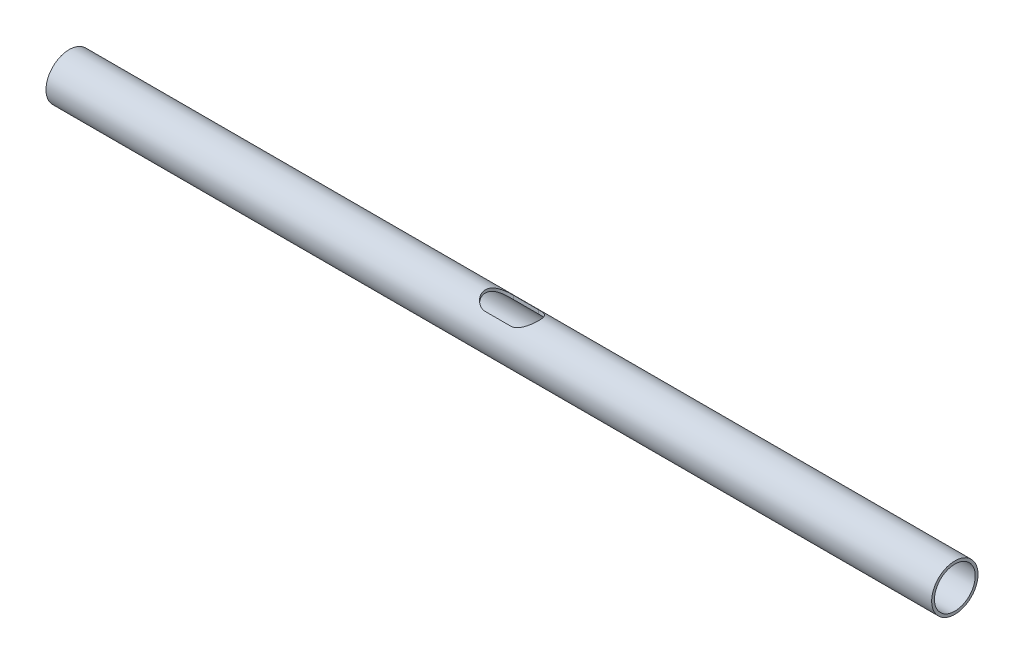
ISO-10303-21;
HEADER;
FILE_DESCRIPTION(('STEP AP214'),'2;1');
FILE_NAME('part.step','',(''),(''),'','','');
FILE_SCHEMA(('AUTOMOTIVE_DESIGN { 1 0 10303 214 1 1 1 1 }'));
ENDSEC;
DATA;
#1=APPLICATION_CONTEXT('core data for automotive mechanical design processes');
#2=APPLICATION_PROTOCOL_DEFINITION('international standard','automotive_design',2000,#1);
#3=PRODUCT_CONTEXT('',#1,'mechanical');
#4=PRODUCT('Part','Part','',(#3));
#5=PRODUCT_RELATED_PRODUCT_CATEGORY('part','',(#4));
#6=PRODUCT_DEFINITION_FORMATION('','',#4);
#7=PRODUCT_DEFINITION_CONTEXT('part definition',#1,'design');
#8=PRODUCT_DEFINITION('design','',#6,#7);
#9=PRODUCT_DEFINITION_SHAPE('','',#8);
#10=(LENGTH_UNIT() NAMED_UNIT(*) SI_UNIT(.MILLI.,.METRE.));
#11=(NAMED_UNIT(*) PLANE_ANGLE_UNIT() SI_UNIT($,.RADIAN.));
#12=(NAMED_UNIT(*) SI_UNIT($,.STERADIAN.) SOLID_ANGLE_UNIT());
#13=UNCERTAINTY_MEASURE_WITH_UNIT(LENGTH_MEASURE(1.E-05),#10,'distance_accuracy_value','');
#14=(GEOMETRIC_REPRESENTATION_CONTEXT(3) GLOBAL_UNCERTAINTY_ASSIGNED_CONTEXT((#13)) GLOBAL_UNIT_ASSIGNED_CONTEXT((#10,
#11,#12)) REPRESENTATION_CONTEXT('',''));
#15=CARTESIAN_POINT('',(0.,0.,0.));
#16=DIRECTION('',(0.,0.,1.));
#17=DIRECTION('',(1.,0.,0.));
#18=AXIS2_PLACEMENT_3D('',#15,#16,#17);
#19=CARTESIAN_POINT('',(-68.8176638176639,0.,0.));
#20=DIRECTION('',(-1.,0.,0.));
#21=DIRECTION('',(0.,0.,1.));
#22=AXIS2_PLACEMENT_3D('',#19,#20,#21);
#23=CYLINDRICAL_SURFACE('',#22,14.5);
#24=CARTESIAN_POINT('',(-315.,0.,0.));
#25=DIRECTION('',(-1.,0.,0.));
#26=DIRECTION('',(0.,0.,1.));
#27=AXIS2_PLACEMENT_3D('',#24,#25,#26);
#28=CIRCLE('',#27,14.5);
#29=CARTESIAN_POINT('',(-315.,0.,14.5));
#30=VERTEX_POINT('',#29);
#31=EDGE_CURVE('E87',#30,#30,#28,.T.);
#32=ORIENTED_EDGE('',*,*,#31,.T.);
#33=EDGE_LOOP('',(#32));
#34=FACE_BOUND('',#33,.T.);
#35=CARTESIAN_POINT('',(315.,0.,0.));
#36=DIRECTION('',(-1.,0.,0.));
#37=DIRECTION('',(0.,0.,1.));
#38=AXIS2_PLACEMENT_3D('',#35,#36,#37);
#39=CIRCLE('',#38,14.5000000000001);
#40=CARTESIAN_POINT('',(315.,0.,14.5000000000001));
#41=VERTEX_POINT('',#40);
#42=EDGE_CURVE('E153',#41,#41,#39,.T.);
#43=ORIENTED_EDGE('',*,*,#42,.F.);
#44=EDGE_LOOP('',(#43));
#45=FACE_BOUND('',#44,.T.);
#46=DIRECTION('',(-1.,0.,0.));
#47=VECTOR('',#46,1.);
#48=CARTESIAN_POINT('',(-68.8176638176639,10.5000000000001,-9.99999999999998));
#49=LINE('',#48,#47);
#50=CARTESIAN_POINT('',(-9.,10.5000000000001,-10.));
#51=VERTEX_POINT('',#50);
#52=CARTESIAN_POINT('',(9.,10.5,-10.));
#53=VERTEX_POINT('',#52);
#54=EDGE_CURVE('E94',#51,#53,#49,.F.);
#55=ORIENTED_EDGE('',*,*,#54,.F.);
#56=CARTESIAN_POINT('',(-9.,10.5000000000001,10.));
#57=CARTESIAN_POINT('',(-9.12158073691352,10.4999936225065,10.0000021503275));
#58=CARTESIAN_POINT('',(-9.24314018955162,10.5021128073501,9.99778205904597));
#59=CARTESIAN_POINT('',(-9.48593911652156,10.5105394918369,9.98892460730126));
#60=CARTESIAN_POINT('',(-9.60717862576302,10.5168465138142,9.98228775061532));
#61=CARTESIAN_POINT('',(-9.96961718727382,10.5419264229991,9.95582316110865));
#62=CARTESIAN_POINT('',(-10.2099659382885,10.5668585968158,9.92944119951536));
#63=CARTESIAN_POINT('',(-10.6835070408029,10.6315418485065,9.86014746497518));
#64=CARTESIAN_POINT('',(-10.9167482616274,10.6711329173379,9.81741401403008));
#65=CARTESIAN_POINT('',(-11.3772011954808,10.7633720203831,9.71619799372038));
#66=CARTESIAN_POINT('',(-11.6044108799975,10.8160243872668,9.65771019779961));
#67=CARTESIAN_POINT('',(-12.0502441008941,10.9319668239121,9.52626433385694));
#68=CARTESIAN_POINT('',(-12.2689102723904,10.9951925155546,9.45339338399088));
#69=CARTESIAN_POINT('',(-12.6982505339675,11.1303883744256,9.29383761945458));
#70=CARTESIAN_POINT('',(-12.9089251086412,11.2023580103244,9.20715364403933));
#71=CARTESIAN_POINT('',(-13.5295493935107,11.4288217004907,8.92690197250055));
#72=CARTESIAN_POINT('',(-13.9270371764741,11.5935763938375,8.71345315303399));
#73=CARTESIAN_POINT('',(-14.5276154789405,11.8644670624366,8.33749276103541));
#74=CARTESIAN_POINT('',(-14.7428021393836,11.9664849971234,8.19071639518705));
#75=CARTESIAN_POINT('',(-15.1605721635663,12.1724942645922,7.88129904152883));
#76=CARTESIAN_POINT('',(-15.3631546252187,12.2764857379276,7.71865692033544));
#77=CARTESIAN_POINT('',(-15.7552380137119,12.4842134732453,7.37795775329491));
#78=CARTESIAN_POINT('',(-15.9447322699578,12.5879495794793,7.19989294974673));
#79=CARTESIAN_POINT('',(-16.3099011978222,12.793038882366,6.82884272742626));
#80=CARTESIAN_POINT('',(-16.4855760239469,12.8943921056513,6.63585747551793));
#81=CARTESIAN_POINT('',(-16.8492820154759,13.1086344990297,6.20329680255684));
#82=CARTESIAN_POINT('',(-17.0347856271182,13.2207713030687,5.96120990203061));
#83=CARTESIAN_POINT('',(-17.3845313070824,13.436197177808,5.45833612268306));
#84=CARTESIAN_POINT('',(-17.5487696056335,13.539484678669,5.1975459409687));
#85=CARTESIAN_POINT('',(-17.8538271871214,13.7341358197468,4.65890499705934));
#86=CARTESIAN_POINT('',(-17.9946802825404,13.8255166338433,4.38107967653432));
#87=CARTESIAN_POINT('',(-18.2511136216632,13.9937032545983,3.80983021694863));
#88=CARTESIAN_POINT('',(-18.3667044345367,14.0705151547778,3.51641266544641));
#89=CARTESIAN_POINT('',(-18.5437319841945,14.1890707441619,2.99529175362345));
#90=CARTESIAN_POINT('',(-18.6114176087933,14.2347257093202,2.77057865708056));
#91=CARTESIAN_POINT('',(-18.7311388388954,14.3158345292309,2.31523593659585));
#92=CARTESIAN_POINT('',(-18.7831776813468,14.3512904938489,2.08460754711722));
#93=CARTESIAN_POINT('',(-18.8709124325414,14.4112417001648,1.61900444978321));
#94=CARTESIAN_POINT('',(-18.9066185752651,14.4357438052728,1.38403255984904));
#95=CARTESIAN_POINT('',(-18.9612402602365,14.473282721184,0.911220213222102));
#96=CARTESIAN_POINT('',(-18.9801552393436,14.4863191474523,0.673379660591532));
#97=CARTESIAN_POINT('',(-19.0009332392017,14.5006416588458,0.196162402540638));
#98=CARTESIAN_POINT('',(-19.0027650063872,14.5019062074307,-0.0432163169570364));
#99=CARTESIAN_POINT('',(-18.9892676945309,14.492599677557,-0.521255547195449));
#100=CARTESIAN_POINT('',(-18.9739386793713,14.4820286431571,-0.759916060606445));
#101=CARTESIAN_POINT('',(-18.926341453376,14.4492891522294,-1.23478959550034));
#102=CARTESIAN_POINT('',(-18.8940691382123,14.4271178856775,-1.47100200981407));
#103=CARTESIAN_POINT('',(-18.8130411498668,14.3716702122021,-1.93924784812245));
#104=CARTESIAN_POINT('',(-18.7642854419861,14.3383937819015,-2.17128126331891));
#105=CARTESIAN_POINT('',(-18.6521220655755,14.2622509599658,-2.62487797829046));
#106=CARTESIAN_POINT('',(-18.5890417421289,14.21959941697,-2.84655874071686));
#107=CARTESIAN_POINT('',(-18.448401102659,14.1251396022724,-3.28334908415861));
#108=CARTESIAN_POINT('',(-18.3708357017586,14.0733281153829,-3.49845632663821));
#109=CARTESIAN_POINT('',(-18.2020559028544,13.9615127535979,-3.92095722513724));
#110=CARTESIAN_POINT('',(-18.1108454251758,13.9015112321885,-4.12835307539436));
#111=CARTESIAN_POINT('',(-17.9155341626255,13.7742969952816,-4.53476639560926));
#112=CARTESIAN_POINT('',(-17.811428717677,13.7070816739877,-4.73378080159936));
#113=CARTESIAN_POINT('',(-17.578772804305,13.5586297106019,-5.14455505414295));
#114=CARTESIAN_POINT('',(-17.4487902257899,13.4766659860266,-5.35524118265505));
#115=CARTESIAN_POINT('',(-17.1748193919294,13.3066197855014,-5.76481292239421));
#116=CARTESIAN_POINT('',(-17.0308251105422,13.2185346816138,-5.96369339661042));
#117=CARTESIAN_POINT('',(-16.7296288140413,13.0377390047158,-6.34923038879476));
#118=CARTESIAN_POINT('',(-16.5724164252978,12.9450248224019,-6.53587709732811));
#119=CARTESIAN_POINT('',(-16.2456129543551,12.7566092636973,-6.89639766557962));
#120=CARTESIAN_POINT('',(-16.0760206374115,12.6609075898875,-7.07027024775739));
#121=CARTESIAN_POINT('',(-15.6945067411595,12.4513755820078,-7.43401726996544));
#122=CARTESIAN_POINT('',(-15.480354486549,12.3372883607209,-7.62141176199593));
#123=CARTESIAN_POINT('',(-15.0365322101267,12.1100520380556,-7.97754805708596));
#124=CARTESIAN_POINT('',(-14.8068589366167,11.9969031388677,-8.14628593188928));
#125=CARTESIAN_POINT('',(-14.3325649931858,11.7746505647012,-8.46435025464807));
#126=CARTESIAN_POINT('',(-14.0879456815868,11.6655465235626,-8.61367846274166));
#127=CARTESIAN_POINT('',(-13.5844460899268,11.4549024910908,-8.89188743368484));
#128=CARTESIAN_POINT('',(-13.3255707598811,11.3533599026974,-9.02077523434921));
#129=CARTESIAN_POINT('',(-12.6584364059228,11.1128082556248,-9.31708875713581));
#130=CARTESIAN_POINT('',(-12.2411415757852,10.9809965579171,-9.47079409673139));
#131=CARTESIAN_POINT('',(-11.5960869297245,10.8141851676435,-9.65973399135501));
#132=CARTESIAN_POINT('',(-11.378164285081,10.7637756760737,-9.71573400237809));
#133=CARTESIAN_POINT('',(-10.9367400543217,10.6749369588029,-9.8132598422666));
#134=CARTESIAN_POINT('',(-10.7132408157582,10.6365027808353,-9.85479165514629));
#135=CARTESIAN_POINT('',(-10.2433785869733,10.5706015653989,-9.9254698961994));
#136=CARTESIAN_POINT('',(-9.99664880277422,10.5442987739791,-9.95331422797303));
#137=CARTESIAN_POINT('',(-9.62435571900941,10.5178129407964,-9.98127020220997));
#138=CARTESIAN_POINT('',(-9.49971286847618,10.5111455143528,-9.98828720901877));
#139=CARTESIAN_POINT('',(-9.25005456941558,10.5022347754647,-9.99765406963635));
#140=CARTESIAN_POINT('',(-9.12503901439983,10.4999928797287,-10.0000024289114));
#141=CARTESIAN_POINT('',(-9.,10.5000000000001,-10.));
#142=B_SPLINE_CURVE_WITH_KNOTS('',3,(#56,#57,#58,#59,#60,#61,#62,#63,#64,#65,#66,#67,#68,#69,
#70,#71,#72,#73,#74,#75,#76,#77,#78,#79,#80,#81,#82,#83,#84,#85,#86,#87,#88,#89,#90,#91,#92,#93,
#94,#95,#96,#97,#98,#99,#100,#101,#102,#103,#104,#105,#106,#107,#108,#109,#110,#111,#112,#113,
#114,#115,#116,#117,#118,#119,#120,#121,#122,#123,#124,#125,#126,#127,#128,#129,#130,#131,#132,
#133,#134,#135,#136,#137,#138,#139,#140,#141),.UNSPECIFIED.,.F.,.F.,(4,2,2,2,2,2,2,2,2,2,2,2,2,
2,2,2,2,2,2,2,2,2,2,2,2,2,2,2,2,2,2,2,2,2,2,2,2,2,2,2,2,2,4),(0.,0.36466204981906,
0.729282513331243,1.45724028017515,2.17747565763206,2.89795027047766,3.61418798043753,
4.33038218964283,5.76618174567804,6.60484172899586,7.44356166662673,8.2827059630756,
9.1218408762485,10.0953768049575,11.0690850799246,12.0413729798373,13.0132533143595,
13.7297739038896,14.4461461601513,15.1620689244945,15.8780156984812,16.5952720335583,
17.3125256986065,18.029953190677,18.7473821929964,19.4498245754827,20.1525140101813,
20.8550019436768,21.5577444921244,22.3392994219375,23.1211919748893,23.9037039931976,
24.6862941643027,25.6050568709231,26.5240126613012,27.442885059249,28.3614403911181,
29.7469828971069,30.4380487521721,31.1288284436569,31.8765122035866,32.2514214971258,
32.6264507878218),.UNSPECIFIED.);
#143=CARTESIAN_POINT('',(-9.,10.5,10.));
#144=VERTEX_POINT('',#143);
#145=EDGE_CURVE('E120',#144,#51,#142,.T.);
#146=ORIENTED_EDGE('',*,*,#145,.F.);
#147=DIRECTION('',(-1.,0.,0.));
#148=VECTOR('',#147,1.);
#149=CARTESIAN_POINT('',(-68.8176638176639,10.5,10.));
#150=LINE('',#149,#148);
#151=CARTESIAN_POINT('',(9.00000000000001,10.5000000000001,10.));
#152=VERTEX_POINT('',#151);
#153=EDGE_CURVE('E127',#144,#152,#150,.F.);
#154=ORIENTED_EDGE('',*,*,#153,.T.);
#155=CARTESIAN_POINT('',(9.,10.5,-10.));
#156=CARTESIAN_POINT('',(9.12158073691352,10.4999936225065,-10.0000021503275));
#157=CARTESIAN_POINT('',(9.24314018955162,10.5021128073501,-9.99778205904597));
#158=CARTESIAN_POINT('',(9.48593911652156,10.5105394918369,-9.98892460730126));
#159=CARTESIAN_POINT('',(9.60717862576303,10.5168465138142,-9.98228775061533));
#160=CARTESIAN_POINT('',(9.96961718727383,10.5419264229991,-9.95582316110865));
#161=CARTESIAN_POINT('',(10.2099659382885,10.5668585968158,-9.92944119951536));
#162=CARTESIAN_POINT('',(10.6835070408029,10.6315418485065,-9.86014746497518));
#163=CARTESIAN_POINT('',(10.9167482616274,10.6711329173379,-9.81741401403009));
#164=CARTESIAN_POINT('',(11.3772011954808,10.7633720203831,-9.71619799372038));
#165=CARTESIAN_POINT('',(11.6044108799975,10.8160243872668,-9.65771019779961));
#166=CARTESIAN_POINT('',(12.0502441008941,10.9319668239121,-9.52626433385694));
#167=CARTESIAN_POINT('',(12.2689102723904,10.9951925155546,-9.45339338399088));
#168=CARTESIAN_POINT('',(12.6982505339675,11.1303883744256,-9.29383761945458));
#169=CARTESIAN_POINT('',(12.9089251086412,11.2023580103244,-9.20715364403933));
#170=CARTESIAN_POINT('',(13.5295493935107,11.4288217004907,-8.92690197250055));
#171=CARTESIAN_POINT('',(13.9270371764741,11.5935763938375,-8.71345315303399));
#172=CARTESIAN_POINT('',(14.5276154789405,11.8644670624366,-8.33749276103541));
#173=CARTESIAN_POINT('',(14.7428021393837,11.9664849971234,-8.19071639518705));
#174=CARTESIAN_POINT('',(15.1605721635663,12.1724942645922,-7.88129904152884));
#175=CARTESIAN_POINT('',(15.3631546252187,12.2764857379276,-7.71865692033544));
#176=CARTESIAN_POINT('',(15.7552380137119,12.4842134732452,-7.37795775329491));
#177=CARTESIAN_POINT('',(15.9447322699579,12.5879495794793,-7.19989294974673));
#178=CARTESIAN_POINT('',(16.3099011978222,12.793038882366,-6.82884272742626));
#179=CARTESIAN_POINT('',(16.4855760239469,12.8943921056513,-6.63585747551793));
#180=CARTESIAN_POINT('',(16.8492820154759,13.1086344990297,-6.20329680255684));
#181=CARTESIAN_POINT('',(17.0347856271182,13.2207713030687,-5.96120990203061));
#182=CARTESIAN_POINT('',(17.3845313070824,13.436197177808,-5.45833612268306));
#183=CARTESIAN_POINT('',(17.5487696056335,13.539484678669,-5.1975459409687));
#184=CARTESIAN_POINT('',(17.8538271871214,13.7341358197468,-4.65890499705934));
#185=CARTESIAN_POINT('',(17.9946802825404,13.8255166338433,-4.38107967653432));
#186=CARTESIAN_POINT('',(18.2511136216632,13.9937032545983,-3.80983021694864));
#187=CARTESIAN_POINT('',(18.3667044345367,14.0705151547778,-3.51641266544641));
#188=CARTESIAN_POINT('',(18.5437319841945,14.1890707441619,-2.99529175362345));
#189=CARTESIAN_POINT('',(18.6114176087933,14.2347257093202,-2.77057865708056));
#190=CARTESIAN_POINT('',(18.7311388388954,14.3158345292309,-2.31523593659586));
#191=CARTESIAN_POINT('',(18.7831776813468,14.3512904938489,-2.08460754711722));
#192=CARTESIAN_POINT('',(18.8709124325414,14.4112417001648,-1.61900444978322));
#193=CARTESIAN_POINT('',(18.9066185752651,14.4357438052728,-1.38403255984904));
#194=CARTESIAN_POINT('',(18.9612402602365,14.473282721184,-0.911220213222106));
#195=CARTESIAN_POINT('',(18.9801552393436,14.4863191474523,-0.673379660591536));
#196=CARTESIAN_POINT('',(19.0009332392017,14.5006416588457,-0.196162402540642));
#197=CARTESIAN_POINT('',(19.0027650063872,14.5019062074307,0.0432163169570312));
#198=CARTESIAN_POINT('',(18.9892676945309,14.492599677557,0.521255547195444));
#199=CARTESIAN_POINT('',(18.9739386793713,14.4820286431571,0.759916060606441));
#200=CARTESIAN_POINT('',(18.926341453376,14.4492891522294,1.23478959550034));
#201=CARTESIAN_POINT('',(18.8940691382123,14.4271178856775,1.47100200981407));
#202=CARTESIAN_POINT('',(18.8130411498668,14.3716702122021,1.93924784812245));
#203=CARTESIAN_POINT('',(18.7642854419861,14.3383937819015,2.17128126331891));
#204=CARTESIAN_POINT('',(18.6521220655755,14.2622509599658,2.62487797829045));
#205=CARTESIAN_POINT('',(18.5890417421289,14.21959941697,2.84655874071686));
#206=CARTESIAN_POINT('',(18.448401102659,14.1251396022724,3.28334908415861));
#207=CARTESIAN_POINT('',(18.3708357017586,14.0733281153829,3.49845632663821));
#208=CARTESIAN_POINT('',(18.2020559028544,13.9615127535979,3.92095722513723));
#209=CARTESIAN_POINT('',(18.1108454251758,13.9015112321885,4.12835307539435));
#210=CARTESIAN_POINT('',(17.9155341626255,13.7742969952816,4.53476639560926));
#211=CARTESIAN_POINT('',(17.811428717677,13.7070816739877,4.73378080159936));
#212=CARTESIAN_POINT('',(17.578772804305,13.5586297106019,5.14455505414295));
#213=CARTESIAN_POINT('',(17.4487902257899,13.4766659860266,5.35524118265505));
#214=CARTESIAN_POINT('',(17.1748193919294,13.3066197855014,5.7648129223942));
#215=CARTESIAN_POINT('',(17.0308251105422,13.2185346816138,5.96369339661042));
#216=CARTESIAN_POINT('',(16.7296288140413,13.0377390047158,6.34923038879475));
#217=CARTESIAN_POINT('',(16.5724164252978,12.9450248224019,6.5358770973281));
#218=CARTESIAN_POINT('',(16.2456129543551,12.7566092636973,6.89639766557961));
#219=CARTESIAN_POINT('',(16.0760206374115,12.6609075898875,7.07027024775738));
#220=CARTESIAN_POINT('',(15.6945067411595,12.4513755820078,7.43401726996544));
#221=CARTESIAN_POINT('',(15.480354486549,12.3372883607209,7.62141176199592));
#222=CARTESIAN_POINT('',(15.0365322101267,12.1100520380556,7.97754805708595));
#223=CARTESIAN_POINT('',(14.8068589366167,11.9969031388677,8.14628593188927));
#224=CARTESIAN_POINT('',(14.3325649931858,11.7746505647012,8.46435025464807));
#225=CARTESIAN_POINT('',(14.0879456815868,11.6655465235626,8.61367846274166));
#226=CARTESIAN_POINT('',(13.5844460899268,11.4549024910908,8.89188743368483));
#227=CARTESIAN_POINT('',(13.3255707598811,11.3533599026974,9.02077523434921));
#228=CARTESIAN_POINT('',(12.6584364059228,11.1128082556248,9.31708875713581));
#229=CARTESIAN_POINT('',(12.2411415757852,10.9809965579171,9.47079409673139));
#230=CARTESIAN_POINT('',(11.5960869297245,10.8141851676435,9.659733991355));
#231=CARTESIAN_POINT('',(11.378164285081,10.7637756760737,9.71573400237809));
#232=CARTESIAN_POINT('',(10.9367400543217,10.6749369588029,9.8132598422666));
#233=CARTESIAN_POINT('',(10.7132408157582,10.6365027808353,9.85479165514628));
#234=CARTESIAN_POINT('',(10.2433785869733,10.5706015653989,9.9254698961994));
#235=CARTESIAN_POINT('',(9.99664880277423,10.5442987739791,9.95331422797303));
#236=CARTESIAN_POINT('',(9.62435571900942,10.5178129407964,9.98127020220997));
#237=CARTESIAN_POINT('',(9.49971286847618,10.5111455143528,9.98828720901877));
#238=CARTESIAN_POINT('',(9.25005456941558,10.5022347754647,9.99765406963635));
#239=CARTESIAN_POINT('',(9.12503901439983,10.4999928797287,10.0000024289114));
#240=CARTESIAN_POINT('',(9.00000000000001,10.5000000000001,10.));
#241=B_SPLINE_CURVE_WITH_KNOTS('',3,(#155,#156,#157,#158,#159,#160,#161,#162,#163,#164,#165,
#166,#167,#168,#169,#170,#171,#172,#173,#174,#175,#176,#177,#178,#179,#180,#181,#182,#183,#184,
#185,#186,#187,#188,#189,#190,#191,#192,#193,#194,#195,#196,#197,#198,#199,#200,#201,#202,#203,
#204,#205,#206,#207,#208,#209,#210,#211,#212,#213,#214,#215,#216,#217,#218,#219,#220,#221,#222,
#223,#224,#225,#226,#227,#228,#229,#230,#231,#232,#233,#234,#235,#236,#237,#238,#239,#240),
.UNSPECIFIED.,.F.,.F.,(4,2,2,2,2,2,2,2,2,2,2,2,2,2,2,2,2,2,2,2,2,2,2,2,2,2,2,2,2,2,2,2,2,2,2,2,
2,2,2,2,2,2,4),(0.,0.364662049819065,0.729282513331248,1.45724028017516,2.17747565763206,
2.89795027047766,3.61418798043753,4.33038218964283,5.76618174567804,6.60484172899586,
7.44356166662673,8.2827059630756,9.1218408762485,10.0953768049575,11.0690850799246,
12.0413729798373,13.0132533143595,13.7297739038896,14.4461461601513,15.1620689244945,
15.8780156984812,16.5952720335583,17.3125256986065,18.029953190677,18.7473821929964,
19.4498245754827,20.1525140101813,20.8550019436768,21.5577444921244,22.3392994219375,
23.1211919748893,23.9037039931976,24.6862941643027,25.6050568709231,26.5240126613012,
27.442885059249,28.3614403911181,29.7469828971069,30.4380487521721,31.1288284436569,
31.8765122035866,32.2514214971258,32.6264507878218),.UNSPECIFIED.);
#242=EDGE_CURVE('E135',#53,#152,#241,.T.);
#243=ORIENTED_EDGE('',*,*,#242,.F.);
#244=EDGE_LOOP('',(#55,#146,#154,#243));
#245=FACE_BOUND('',#244,.T.);
#246=ADVANCED_FACE('F44',(#34,#45,#245),#23,.F.);
#247=CARTESIAN_POINT('',(-68.8176638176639,0.,0.));
#248=DIRECTION('',(-1.,0.,0.));
#249=DIRECTION('',(0.,0.,1.));
#250=AXIS2_PLACEMENT_3D('',#247,#248,#249);
#251=CYLINDRICAL_SURFACE('',#250,16.5);
#252=CARTESIAN_POINT('',(315.,0.,0.));
#253=DIRECTION('',(-1.,0.,0.));
#254=DIRECTION('',(0.,0.,1.));
#255=AXIS2_PLACEMENT_3D('',#252,#253,#254);
#256=CIRCLE('',#255,16.5000000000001);
#257=CARTESIAN_POINT('',(315.,0.,16.5000000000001));
#258=VERTEX_POINT('',#257);
#259=EDGE_CURVE('E156',#258,#258,#256,.T.);
#260=ORIENTED_EDGE('',*,*,#259,.T.);
#261=EDGE_LOOP('',(#260));
#262=FACE_BOUND('',#261,.T.);
#263=CARTESIAN_POINT('',(-315.,0.,0.));
#264=DIRECTION('',(-1.,0.,0.));
#265=DIRECTION('',(0.,0.,1.));
#266=AXIS2_PLACEMENT_3D('',#263,#264,#265);
#267=CIRCLE('',#266,16.5);
#268=CARTESIAN_POINT('',(-315.,0.,16.5));
#269=VERTEX_POINT('',#268);
#270=EDGE_CURVE('E158',#269,#269,#267,.T.);
#271=ORIENTED_EDGE('',*,*,#270,.F.);
#272=EDGE_LOOP('',(#271));
#273=FACE_BOUND('',#272,.T.);
#274=DIRECTION('',(-1.,0.,0.));
#275=VECTOR('',#274,1.);
#276=CARTESIAN_POINT('',(-68.8176638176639,13.1244047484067,-9.99999999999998));
#277=LINE('',#276,#275);
#278=CARTESIAN_POINT('',(9.,13.1244047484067,-10.));
#279=VERTEX_POINT('',#278);
#280=CARTESIAN_POINT('',(-9.,13.1244047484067,-10.));
#281=VERTEX_POINT('',#280);
#282=EDGE_CURVE('E13',#279,#281,#277,.T.);
#283=ORIENTED_EDGE('',*,*,#282,.F.);
#284=CARTESIAN_POINT('',(9.00000000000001,13.1244047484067,10.));
#285=CARTESIAN_POINT('',(9.12614883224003,13.1244002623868,10.0000015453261));
#286=CARTESIAN_POINT('',(9.25227802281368,13.1262243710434,9.99761236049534));
#287=CARTESIAN_POINT('',(9.50424332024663,13.133484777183,9.98807440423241));
#288=CARTESIAN_POINT('',(9.63007944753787,13.1389208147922,9.98092597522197));
#289=CARTESIAN_POINT('',(10.0064815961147,13.1605617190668,9.95239785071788));
#290=CARTESIAN_POINT('',(10.2562572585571,13.1820996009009,9.92393519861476));
#291=CARTESIAN_POINT('',(10.7494081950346,13.2382338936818,9.84892444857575));
#292=CARTESIAN_POINT('',(10.9928190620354,13.2727223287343,9.80252580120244));
#293=CARTESIAN_POINT('',(11.473728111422,13.3533934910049,9.692344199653));
#294=CARTESIAN_POINT('',(11.7112250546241,13.3995786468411,9.62855763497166));
#295=CARTESIAN_POINT('',(12.1779937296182,13.5017762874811,9.48471270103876));
#296=CARTESIAN_POINT('',(12.4072936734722,13.557750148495,9.40471809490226));
#297=CARTESIAN_POINT('',(12.8575751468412,13.677857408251,9.2291671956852));
#298=CARTESIAN_POINT('',(13.0785569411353,13.7419905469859,9.13361139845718));
#299=CARTESIAN_POINT('',(13.7287873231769,13.9442272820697,8.82435432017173));
#300=CARTESIAN_POINT('',(14.1445770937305,14.0919952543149,8.58829585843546));
#301=CARTESIAN_POINT('',(14.984525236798,14.4186129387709,8.02936294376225));
#302=CARTESIAN_POINT('',(15.4033158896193,14.5990439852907,7.69934929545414));
#303=CARTESIAN_POINT('',(15.9884624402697,14.8680456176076,7.15766138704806));
#304=CARTESIAN_POINT('',(16.1764204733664,14.9574825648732,6.96921592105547));
#305=CARTESIAN_POINT('',(16.5373096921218,15.133942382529,6.57722806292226));
#306=CARTESIAN_POINT('',(16.7102377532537,15.2209647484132,6.37368254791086));
#307=CARTESIAN_POINT('',(17.0584546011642,15.4001294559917,5.92872508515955));
#308=CARTESIAN_POINT('',(17.2318527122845,15.4917592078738,5.68562239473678));
#309=CARTESIAN_POINT('',(17.5572588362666,15.6670961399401,5.1829439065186));
#310=CARTESIAN_POINT('',(17.7092765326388,15.750806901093,4.92337564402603));
#311=CARTESIAN_POINT('',(17.990321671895,15.9079324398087,4.38920850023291));
#312=CARTESIAN_POINT('',(18.119357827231,15.9813511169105,4.11461536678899));
#313=CARTESIAN_POINT('',(18.3527786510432,16.1156865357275,3.55220756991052));
#314=CARTESIAN_POINT('',(18.4571674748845,16.1766053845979,3.26439514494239));
#315=CARTESIAN_POINT('',(18.6308081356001,16.2787602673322,2.70637287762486));
#316=CARTESIAN_POINT('',(18.7024852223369,16.3213319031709,2.43716144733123));
#317=CARTESIAN_POINT('',(18.8233498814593,16.393469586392,1.89201439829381));
#318=CARTESIAN_POINT('',(18.8725387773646,16.4230363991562,1.616079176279));
#319=CARTESIAN_POINT('',(18.9475976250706,16.4682665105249,1.06014822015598));
#320=CARTESIAN_POINT('',(18.9734862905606,16.4839409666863,0.780155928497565));
#321=CARTESIAN_POINT('',(19.0015622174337,16.5009428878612,0.218561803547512));
#322=CARTESIAN_POINT('',(19.0037519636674,16.5022718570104,-0.0630398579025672));
#323=CARTESIAN_POINT('',(18.9856320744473,16.4912952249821,-0.589481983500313));
#324=CARTESIAN_POINT('',(18.9681368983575,16.4806951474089,-0.834461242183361));
#325=CARTESIAN_POINT('',(18.9152886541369,16.4487842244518,-1.32178278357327));
#326=CARTESIAN_POINT('',(18.8799356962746,16.4274734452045,-1.56412508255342));
#327=CARTESIAN_POINT('',(18.7918211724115,16.3746304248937,-2.0444732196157));
#328=CARTESIAN_POINT('',(18.7390598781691,16.3430983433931,-2.28247912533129));
#329=CARTESIAN_POINT('',(18.616752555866,16.2705103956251,-2.7526499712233));
#330=CARTESIAN_POINT('',(18.5472058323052,16.2294541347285,-2.98481466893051));
#331=CARTESIAN_POINT('',(18.391705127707,16.1384674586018,-3.44306624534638));
#332=CARTESIAN_POINT('',(18.3056739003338,16.0884953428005,-3.66911855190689));
#333=CARTESIAN_POINT('',(18.1182223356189,15.9808038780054,-4.1129150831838));
#334=CARTESIAN_POINT('',(18.0167968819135,15.9230819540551,-4.33065651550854));
#335=CARTESIAN_POINT('',(17.7994510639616,15.8010207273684,-4.75676936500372));
#336=CARTESIAN_POINT('',(17.6835339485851,15.7366829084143,-4.9651428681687));
#337=CARTESIAN_POINT('',(17.4379727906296,15.6025256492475,-5.37187831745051));
#338=CARTESIAN_POINT('',(17.3083238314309,15.5327042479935,-5.57023663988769));
#339=CARTESIAN_POINT('',(17.0197310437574,15.380160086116,-5.97945728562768));
#340=CARTESIAN_POINT('',(16.8591391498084,15.2968953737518,-6.18895661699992));
#341=CARTESIAN_POINT('',(16.522648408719,15.1267695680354,-6.59386824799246));
#342=CARTESIAN_POINT('',(16.3467425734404,15.0399068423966,-6.78927404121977));
#343=CARTESIAN_POINT('',(15.9802846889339,14.8643355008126,-7.16552047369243));
#344=CARTESIAN_POINT('',(15.7897126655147,14.7756244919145,-7.34634053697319));
#345=CARTESIAN_POINT('',(15.3948886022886,14.5984067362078,-7.69248552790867));
#346=CARTESIAN_POINT('',(15.1906360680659,14.5098999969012,-7.857809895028));
#347=CARTESIAN_POINT('',(14.7437252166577,14.3246009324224,-8.19124063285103));
#348=CARTESIAN_POINT('',(14.4994038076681,14.228094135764,-8.35728508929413));
#349=CARTESIAN_POINT('',(13.9953197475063,14.040956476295,-8.66801307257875));
#350=CARTESIAN_POINT('',(13.7355546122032,13.9503265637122,-8.81269314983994));
#351=CARTESIAN_POINT('',(13.2025474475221,13.7785332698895,-9.07893429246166));
#352=CARTESIAN_POINT('',(12.9293518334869,13.697340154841,-9.20056877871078));
#353=CARTESIAN_POINT('',(12.37018397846,13.5475350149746,-9.41976357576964));
#354=CARTESIAN_POINT('',(12.0842169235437,13.4789179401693,-9.51733355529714));
#355=CARTESIAN_POINT('',(11.5700198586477,13.3718906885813,-9.66689642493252));
#356=CARTESIAN_POINT('',(11.3440159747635,13.3301713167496,-9.72421162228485));
#357=CARTESIAN_POINT('',(10.8869581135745,13.2574412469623,-9.82313751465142));
#358=CARTESIAN_POINT('',(10.6559058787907,13.2264269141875,-9.8647535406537));
#359=CARTESIAN_POINT('',(10.1884520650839,13.1760420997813,-9.93195402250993));
#360=CARTESIAN_POINT('',(9.9520238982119,13.1567573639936,-9.95742047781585));
#361=CARTESIAN_POINT('',(9.59589855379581,13.137388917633,-9.98294100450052));
#362=CARTESIAN_POINT('',(9.47687067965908,13.1325258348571,-9.98933467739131));
#363=CARTESIAN_POINT('',(9.238567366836,13.1260318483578,-9.99786493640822));
#364=CARTESIAN_POINT('',(9.11929191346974,13.124401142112,-10.0000012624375));
#365=CARTESIAN_POINT('',(9.,13.1244047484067,-10.));
#366=B_SPLINE_CURVE_WITH_KNOTS('',3,(#284,#285,#286,#287,#288,#289,#290,#291,#292,#293,#294,
#295,#296,#297,#298,#299,#300,#301,#302,#303,#304,#305,#306,#307,#308,#309,#310,#311,#312,#313,
#314,#315,#316,#317,#318,#319,#320,#321,#322,#323,#324,#325,#326,#327,#328,#329,#330,#331,#332,
#333,#334,#335,#336,#337,#338,#339,#340,#341,#342,#343,#344,#345,#346,#347,#348,#349,#350,#351,
#352,#353,#354,#355,#356,#357,#358,#359,#360,#361,#362,#363,#364,#365),.UNSPECIFIED.,.F.,.F.,(4,
2,2,2,2,2,2,2,2,2,2,2,2,2,2,2,2,2,2,2,2,2,2,2,2,2,2,2,2,2,2,2,2,2,2,2,2,2,2,2,4),(0.,
0.3783721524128,0.75671708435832,1.51246316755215,2.26204325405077,3.01177910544,
3.75862081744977,4.50543873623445,6.00144445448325,7.68314807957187,8.52483413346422,
9.3666947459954,10.302516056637,11.2379121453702,12.1729528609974,13.1078358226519,
13.9520880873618,14.796290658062,15.6398145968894,16.4832500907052,17.2198630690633,
17.9564714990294,18.6930684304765,19.4296958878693,20.1698635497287,20.9102777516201,
21.650526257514,22.3910407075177,23.2205667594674,24.0504733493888,24.8815309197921,
25.7126185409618,26.6437758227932,27.575083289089,28.5033718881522,29.4312869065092,
30.1411200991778,30.8507120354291,31.5654307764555,31.9232220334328,32.2810351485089),.UNSPECIFIED.);
#367=CARTESIAN_POINT('',(9.00000000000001,13.1244047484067,10.));
#368=VERTEX_POINT('',#367);
#369=EDGE_CURVE('E81',#368,#279,#366,.T.);
#370=ORIENTED_EDGE('',*,*,#369,.F.);
#371=DIRECTION('',(-1.,0.,0.));
#372=VECTOR('',#371,1.);
#373=CARTESIAN_POINT('',(-68.8176638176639,13.1244047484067,10.));
#374=LINE('',#373,#372);
#375=CARTESIAN_POINT('',(-9.,13.1244047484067,10.));
#376=VERTEX_POINT('',#375);
#377=EDGE_CURVE('E86',#368,#376,#374,.T.);
#378=ORIENTED_EDGE('',*,*,#377,.T.);
#379=CARTESIAN_POINT('',(-9.,13.1244047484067,-10.));
#380=CARTESIAN_POINT('',(-9.12614883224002,13.1244002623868,-10.0000015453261));
#381=CARTESIAN_POINT('',(-9.25227802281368,13.1262243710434,-9.99761236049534));
#382=CARTESIAN_POINT('',(-9.50424332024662,13.133484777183,-9.98807440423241));
#383=CARTESIAN_POINT('',(-9.63007944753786,13.1389208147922,-9.98092597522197));
#384=CARTESIAN_POINT('',(-10.0064815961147,13.1605617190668,-9.95239785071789));
#385=CARTESIAN_POINT('',(-10.2562572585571,13.1820996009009,-9.92393519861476));
#386=CARTESIAN_POINT('',(-10.7494081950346,13.2382338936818,-9.84892444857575));
#387=CARTESIAN_POINT('',(-10.9928190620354,13.2727223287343,-9.80252580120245));
#388=CARTESIAN_POINT('',(-11.473728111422,13.3533934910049,-9.692344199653));
#389=CARTESIAN_POINT('',(-11.7112250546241,13.3995786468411,-9.62855763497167));
#390=CARTESIAN_POINT('',(-12.1779937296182,13.5017762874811,-9.48471270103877));
#391=CARTESIAN_POINT('',(-12.4072936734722,13.557750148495,-9.40471809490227));
#392=CARTESIAN_POINT('',(-12.8575751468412,13.677857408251,-9.22916719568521));
#393=CARTESIAN_POINT('',(-13.0785569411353,13.7419905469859,-9.13361139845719));
#394=CARTESIAN_POINT('',(-13.7287873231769,13.9442272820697,-8.82435432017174));
#395=CARTESIAN_POINT('',(-14.1445770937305,14.0919952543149,-8.58829585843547));
#396=CARTESIAN_POINT('',(-14.984525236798,14.4186129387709,-8.02936294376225));
#397=CARTESIAN_POINT('',(-15.4033158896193,14.5990439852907,-7.69934929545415));
#398=CARTESIAN_POINT('',(-15.9884624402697,14.8680456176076,-7.15766138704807));
#399=CARTESIAN_POINT('',(-16.1764204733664,14.9574825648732,-6.96921592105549));
#400=CARTESIAN_POINT('',(-16.5373096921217,15.133942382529,-6.57722806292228));
#401=CARTESIAN_POINT('',(-16.7102377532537,15.2209647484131,-6.37368254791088));
#402=CARTESIAN_POINT('',(-17.0584546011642,15.4001294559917,-5.92872508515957));
#403=CARTESIAN_POINT('',(-17.2318527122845,15.4917592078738,-5.68562239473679));
#404=CARTESIAN_POINT('',(-17.5572588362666,15.6670961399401,-5.18294390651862));
#405=CARTESIAN_POINT('',(-17.7092765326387,15.750806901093,-4.92337564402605));
#406=CARTESIAN_POINT('',(-17.990321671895,15.9079324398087,-4.38920850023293));
#407=CARTESIAN_POINT('',(-18.119357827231,15.9813511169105,-4.11461536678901));
#408=CARTESIAN_POINT('',(-18.3527786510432,16.1156865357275,-3.55220756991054));
#409=CARTESIAN_POINT('',(-18.4571674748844,16.1766053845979,-3.26439514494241));
#410=CARTESIAN_POINT('',(-18.6308081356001,16.2787602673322,-2.70637287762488));
#411=CARTESIAN_POINT('',(-18.7024852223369,16.3213319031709,-2.43716144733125));
#412=CARTESIAN_POINT('',(-18.8233498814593,16.393469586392,-1.89201439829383));
#413=CARTESIAN_POINT('',(-18.8725387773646,16.4230363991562,-1.61607917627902));
#414=CARTESIAN_POINT('',(-18.9475976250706,16.4682665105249,-1.060148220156));
#415=CARTESIAN_POINT('',(-18.9734862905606,16.4839409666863,-0.780155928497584));
#416=CARTESIAN_POINT('',(-19.0015622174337,16.5009428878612,-0.21856180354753));
#417=CARTESIAN_POINT('',(-19.0037519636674,16.5022718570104,0.0630398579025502));
#418=CARTESIAN_POINT('',(-18.9856320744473,16.4912952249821,0.589481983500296));
#419=CARTESIAN_POINT('',(-18.9681368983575,16.4806951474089,0.834461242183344));
#420=CARTESIAN_POINT('',(-18.9152886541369,16.4487842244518,1.32178278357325));
#421=CARTESIAN_POINT('',(-18.8799356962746,16.4274734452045,1.5641250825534));
#422=CARTESIAN_POINT('',(-18.7918211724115,16.3746304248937,2.04447321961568));
#423=CARTESIAN_POINT('',(-18.7390598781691,16.3430983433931,2.28247912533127));
#424=CARTESIAN_POINT('',(-18.616752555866,16.2705103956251,2.75264997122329));
#425=CARTESIAN_POINT('',(-18.5472058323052,16.2294541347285,2.98481466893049));
#426=CARTESIAN_POINT('',(-18.391705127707,16.1384674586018,3.44306624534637));
#427=CARTESIAN_POINT('',(-18.3056739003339,16.0884953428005,3.66911855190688));
#428=CARTESIAN_POINT('',(-18.1182223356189,15.9808038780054,4.11291508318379));
#429=CARTESIAN_POINT('',(-18.0167968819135,15.9230819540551,4.33065651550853));
#430=CARTESIAN_POINT('',(-17.7994510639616,15.8010207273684,4.75676936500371));
#431=CARTESIAN_POINT('',(-17.6835339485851,15.7366829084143,4.96514286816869));
#432=CARTESIAN_POINT('',(-17.4379727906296,15.6025256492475,5.3718783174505));
#433=CARTESIAN_POINT('',(-17.3083238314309,15.5327042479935,5.57023663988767));
#434=CARTESIAN_POINT('',(-17.0197310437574,15.380160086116,5.97945728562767));
#435=CARTESIAN_POINT('',(-16.8591391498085,15.2968953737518,6.18895661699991));
#436=CARTESIAN_POINT('',(-16.522648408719,15.1267695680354,6.59386824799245));
#437=CARTESIAN_POINT('',(-16.3467425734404,15.0399068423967,6.78927404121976));
#438=CARTESIAN_POINT('',(-15.9802846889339,14.8643355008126,7.16552047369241));
#439=CARTESIAN_POINT('',(-15.7897126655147,14.7756244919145,7.34634053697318));
#440=CARTESIAN_POINT('',(-15.3948886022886,14.5984067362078,7.69248552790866));
#441=CARTESIAN_POINT('',(-15.1906360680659,14.5098999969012,7.85780989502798));
#442=CARTESIAN_POINT('',(-14.7437252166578,14.3246009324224,8.19124063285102));
#443=CARTESIAN_POINT('',(-14.4994038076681,14.228094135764,8.35728508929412));
#444=CARTESIAN_POINT('',(-13.9953197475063,14.040956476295,8.66801307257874));
#445=CARTESIAN_POINT('',(-13.7355546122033,13.9503265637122,8.81269314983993));
#446=CARTESIAN_POINT('',(-13.2025474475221,13.7785332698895,9.07893429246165));
#447=CARTESIAN_POINT('',(-12.9293518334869,13.697340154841,9.20056877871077));
#448=CARTESIAN_POINT('',(-12.3701839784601,13.5475350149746,9.41976357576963));
#449=CARTESIAN_POINT('',(-12.0842169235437,13.4789179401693,9.51733355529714));
#450=CARTESIAN_POINT('',(-11.5700198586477,13.3718906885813,9.66689642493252));
#451=CARTESIAN_POINT('',(-11.3440159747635,13.3301713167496,9.72421162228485));
#452=CARTESIAN_POINT('',(-10.8869581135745,13.2574412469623,9.82313751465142));
#453=CARTESIAN_POINT('',(-10.6559058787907,13.2264269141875,9.8647535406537));
#454=CARTESIAN_POINT('',(-10.1884520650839,13.1760420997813,9.93195402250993));
#455=CARTESIAN_POINT('',(-9.9520238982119,13.1567573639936,9.95742047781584));
#456=CARTESIAN_POINT('',(-9.59589855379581,13.137388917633,9.98294100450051));
#457=CARTESIAN_POINT('',(-9.47687067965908,13.1325258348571,9.98933467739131));
#458=CARTESIAN_POINT('',(-9.238567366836,13.1260318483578,9.99786493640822));
#459=CARTESIAN_POINT('',(-9.11929191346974,13.124401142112,10.0000012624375));
#460=CARTESIAN_POINT('',(-9.,13.1244047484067,10.));
#461=B_SPLINE_CURVE_WITH_KNOTS('',3,(#379,#380,#381,#382,#383,#384,#385,#386,#387,#388,#389,
#390,#391,#392,#393,#394,#395,#396,#397,#398,#399,#400,#401,#402,#403,#404,#405,#406,#407,#408,
#409,#410,#411,#412,#413,#414,#415,#416,#417,#418,#419,#420,#421,#422,#423,#424,#425,#426,#427,
#428,#429,#430,#431,#432,#433,#434,#435,#436,#437,#438,#439,#440,#441,#442,#443,#444,#445,#446,
#447,#448,#449,#450,#451,#452,#453,#454,#455,#456,#457,#458,#459,#460),.UNSPECIFIED.,.F.,.F.,(4,
2,2,2,2,2,2,2,2,2,2,2,2,2,2,2,2,2,2,2,2,2,2,2,2,2,2,2,2,2,2,2,2,2,2,2,2,2,2,2,4),(0.,
0.378372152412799,0.756717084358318,1.51246316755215,2.26204325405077,3.01177910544,
3.75862081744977,4.50543873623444,6.00144445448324,7.68314807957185,8.5248341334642,
9.36669474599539,10.302516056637,11.2379121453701,12.1729528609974,13.1078358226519,
13.9520880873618,14.7962906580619,15.6398145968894,16.4832500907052,17.2198630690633,
17.9564714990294,18.6930684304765,19.4296958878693,20.1698635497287,20.9102777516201,
21.650526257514,22.3910407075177,23.2205667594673,24.0504733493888,24.8815309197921,
25.7126185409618,26.6437758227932,27.575083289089,28.5033718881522,29.4312869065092,
30.1411200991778,30.8507120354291,31.5654307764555,31.9232220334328,32.2810351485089),.UNSPECIFIED.);
#462=EDGE_CURVE('E52',#281,#376,#461,.T.);
#463=ORIENTED_EDGE('',*,*,#462,.F.);
#464=EDGE_LOOP('',(#283,#370,#378,#463));
#465=FACE_BOUND('',#464,.T.);
#466=ADVANCED_FACE('F98',(#262,#273,#465),#251,.T.);
#467=CARTESIAN_POINT('',(-315.,16.5,0.));
#468=DIRECTION('',(1.,0.,0.));
#469=DIRECTION('',(0.,0.,-1.));
#470=AXIS2_PLACEMENT_3D('',#467,#468,#469);
#471=PLANE('',#470);
#472=ORIENTED_EDGE('',*,*,#31,.F.);
#473=EDGE_LOOP('',(#472));
#474=FACE_BOUND('',#473,.T.);
#475=ORIENTED_EDGE('',*,*,#270,.T.);
#476=EDGE_LOOP('',(#475));
#477=FACE_BOUND('',#476,.T.);
#478=ADVANCED_FACE('F46',(#474,#477),#471,.F.);
#479=CARTESIAN_POINT('',(315.,16.5000000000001,0.));
#480=DIRECTION('',(-1.,0.,0.));
#481=DIRECTION('',(0.,0.,1.));
#482=AXIS2_PLACEMENT_3D('',#479,#480,#481);
#483=PLANE('',#482);
#484=ORIENTED_EDGE('',*,*,#259,.F.);
#485=EDGE_LOOP('',(#484));
#486=FACE_BOUND('',#485,.T.);
#487=ORIENTED_EDGE('',*,*,#42,.T.);
#488=EDGE_LOOP('',(#487));
#489=FACE_BOUND('',#488,.T.);
#490=ADVANCED_FACE('F133',(#486,#489),#483,.F.);
#491=CARTESIAN_POINT('',(8.99999999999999,36.,-10.));
#492=DIRECTION('',(0.,0.,1.));
#493=DIRECTION('',(1.,0.,0.));
#494=AXIS2_PLACEMENT_3D('',#491,#492,#493);
#495=PLANE('',#494);
#496=ORIENTED_EDGE('',*,*,#54,.T.);
#497=DIRECTION('',(0.,-1.,0.));
#498=VECTOR('',#497,1.);
#499=CARTESIAN_POINT('',(9.,36.,-10.));
#500=LINE('',#499,#498);
#501=EDGE_CURVE('E59',#279,#53,#500,.T.);
#502=ORIENTED_EDGE('',*,*,#501,.F.);
#503=ORIENTED_EDGE('',*,*,#282,.T.);
#504=DIRECTION('',(0.,-1.,0.));
#505=VECTOR('',#504,1.);
#506=CARTESIAN_POINT('',(-9.,36.,-10.));
#507=LINE('',#506,#505);
#508=EDGE_CURVE('E141',#281,#51,#507,.T.);
#509=ORIENTED_EDGE('',*,*,#508,.T.);
#510=EDGE_LOOP('',(#496,#502,#503,#509));
#511=FACE_BOUND('',#510,.T.);
#512=ADVANCED_FACE('F90',(#511),#495,.T.);
#513=CARTESIAN_POINT('',(-9.,36.,0.));
#514=DIRECTION('',(0.,-1.,0.));
#515=DIRECTION('',(0.,0.,-1.));
#516=AXIS2_PLACEMENT_3D('',#513,#514,#515);
#517=CYLINDRICAL_SURFACE('',#516,10.);
#518=ORIENTED_EDGE('',*,*,#145,.T.);
#519=ORIENTED_EDGE('',*,*,#508,.F.);
#520=ORIENTED_EDGE('',*,*,#462,.T.);
#521=DIRECTION('',(0.,-1.,0.));
#522=VECTOR('',#521,1.);
#523=CARTESIAN_POINT('',(-9.,36.,10.));
#524=LINE('',#523,#522);
#525=EDGE_CURVE('E180',#376,#144,#524,.T.);
#526=ORIENTED_EDGE('',*,*,#525,.T.);
#527=EDGE_LOOP('',(#518,#519,#520,#526));
#528=FACE_BOUND('',#527,.T.);
#529=ADVANCED_FACE('F112',(#528),#517,.F.);
#530=CARTESIAN_POINT('',(9.00000000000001,36.,10.));
#531=DIRECTION('',(0.,0.,1.));
#532=DIRECTION('',(1.,0.,0.));
#533=AXIS2_PLACEMENT_3D('',#530,#531,#532);
#534=PLANE('',#533);
#535=ORIENTED_EDGE('',*,*,#525,.F.);
#536=ORIENTED_EDGE('',*,*,#377,.F.);
#537=DIRECTION('',(0.,-1.,0.));
#538=VECTOR('',#537,1.);
#539=CARTESIAN_POINT('',(9.00000000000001,36.,10.));
#540=LINE('',#539,#538);
#541=EDGE_CURVE('E64',#368,#152,#540,.T.);
#542=ORIENTED_EDGE('',*,*,#541,.T.);
#543=ORIENTED_EDGE('',*,*,#153,.F.);
#544=EDGE_LOOP('',(#535,#536,#542,#543));
#545=FACE_BOUND('',#544,.T.);
#546=ADVANCED_FACE('F116',(#545),#534,.F.);
#547=CARTESIAN_POINT('',(9.,36.,0.));
#548=DIRECTION('',(0.,-1.,0.));
#549=DIRECTION('',(0.,0.,-1.));
#550=AXIS2_PLACEMENT_3D('',#547,#548,#549);
#551=CYLINDRICAL_SURFACE('',#550,10.);
#552=ORIENTED_EDGE('',*,*,#242,.T.);
#553=ORIENTED_EDGE('',*,*,#541,.F.);
#554=ORIENTED_EDGE('',*,*,#369,.T.);
#555=ORIENTED_EDGE('',*,*,#501,.T.);
#556=EDGE_LOOP('',(#552,#553,#554,#555));
#557=FACE_BOUND('',#556,.T.);
#558=ADVANCED_FACE('F82',(#557),#551,.F.);
#559=CLOSED_SHELL('',(#246,#466,#478,#490,#512,#529,#546,#558));
#560=MANIFOLD_SOLID_BREP('B2',#559);
#561=ADVANCED_BREP_SHAPE_REPRESENTATION('',(#18,#560),#14);
#562=SHAPE_DEFINITION_REPRESENTATION(#9,#561);
ENDSEC;
END-ISO-10303-21;
